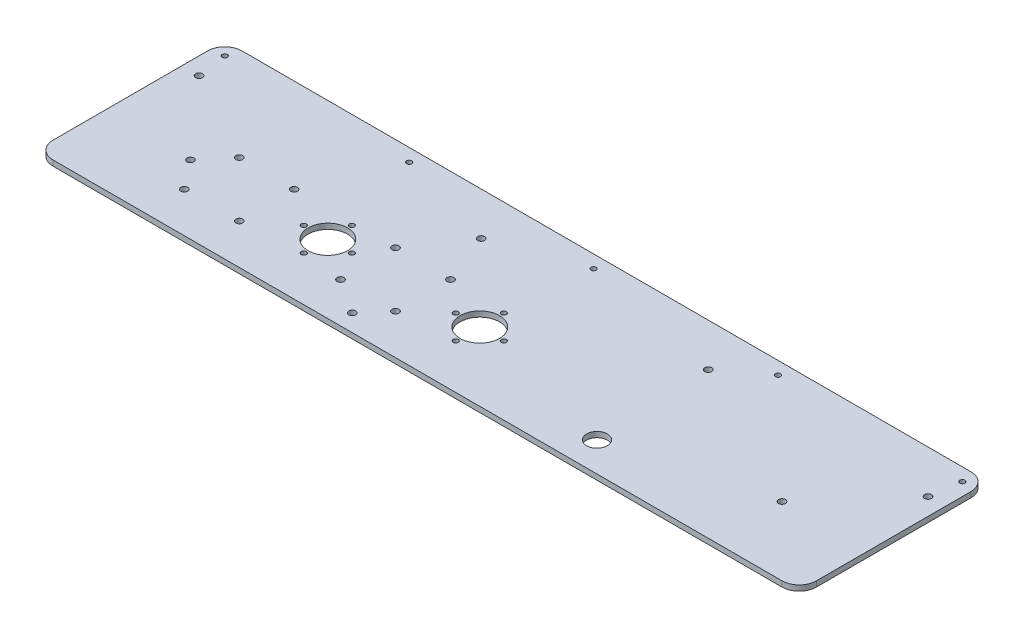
from build123d import *

# Parameters (mm, degrees)
SKETCH1_R           = 2
SKETCH1_R_2         = 1.5
SKETCH1_R_3         = 11.5
SKETCH1_R_4         = 6
BOSS_EXTRUDE1_DEPTH = 3.175
FILLET1_R           = 10
SKETCH2_R           = 2
CUT_EXTRUDE1_DEPTH  = 10


with BuildPart() as part:
    # Sketch1 → Boss-Extrude1 (new body)
    with BuildSketch(Plane(origin=(0, 0, 0), x_dir=(1, 0, 0), z_dir=(0, 1, 0))):
        Polygon((417.700422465, 110), (-26.799577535, 110), (-26.799577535, 0), (417.700422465, 0), (417.700422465, 17.22815868), align=None)
        with Locations(Location((147.450422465, 10, 0), (0, 0, 270))):
            Circle(SKETCH1_R, mode=Mode.SUBTRACT)
        with Locations(Location((103.200422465, 26, 0), (0, 0, 270))):
            Circle(SKETCH1_R_2, mode=Mode.SUBTRACT)
        with Locations(Location((23.200422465, 40, 0), (0, 0, 270))):
            Circle(SKETCH1_R, mode=Mode.SUBTRACT)
        with Locations(Location((89.200422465, 40, 0), (0, 0, 270))):
            Circle(SKETCH1_R_2, mode=Mode.SUBTRACT)
        with Locations(Location((103.200422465, 40, 0), (0, 0, 270))):
            Circle(SKETCH1_R_3, mode=Mode.SUBTRACT)
        with Locations(Location((117.200422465, 40, 0), (0, 0, 270))):
            Circle(SKETCH1_R_2, mode=Mode.SUBTRACT)
        with Locations(Location((177.700422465, 40, 0), (0, 0, 270))):
            Circle(SKETCH1_R_2, mode=Mode.SUBTRACT)
        with Locations(Location((191.700422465, 26, 0), (0, 0, 270))):
            Circle(SKETCH1_R_2, mode=Mode.SUBTRACT)
        with Locations(Location((191.700422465, 40, 0), (0, 0, 270))):
            Circle(SKETCH1_R_3, mode=Mode.SUBTRACT)
        with Locations(Location((205.700422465, 40, 0), (0, 0, 270))):
            Circle(SKETCH1_R_2, mode=Mode.SUBTRACT)
        with Locations(Location((103.200422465, 54, 0), (0, 0, 270))):
            Circle(SKETCH1_R_2, mode=Mode.SUBTRACT)
        with Locations(Location((191.700422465, 54, 0), (0, 0, 270))):
            Circle(SKETCH1_R_2, mode=Mode.SUBTRACT)
        with Locations(Location((282.700422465, 17.22815868, 0), (0, 0, 270))):
            Circle(SKETCH1_R_4, mode=Mode.SUBTRACT)
        with Locations(Location((367.700422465, 40, 0), (0, 0, 270))):
            Circle(SKETCH1_R, mode=Mode.SUBTRACT)
        with Locations(Location((-16.799577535, 85, 0), (0, 0, 270))):
            Circle(SKETCH1_R, mode=Mode.SUBTRACT)
        with Locations(Location((-19.299577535, 102.5, 0), (0, 0, 270))):
            Circle(SKETCH1_R_2, mode=Mode.SUBTRACT)
        with Locations(Location((147.450422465, 85, 0), (0, 0, 270))):
            Circle(SKETCH1_R, mode=Mode.SUBTRACT)
        with Locations(Location((88.075422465, 102.5, 0), (0, 0, 270))):
            Circle(SKETCH1_R_2, mode=Mode.SUBTRACT)
        with Locations(Location((279.700422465, 85, 0), (0, 0, 270))):
            Circle(SKETCH1_R, mode=Mode.SUBTRACT)
        with Locations(Location((195.450422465, 102.5, 0), (0, 0, 270))):
            Circle(SKETCH1_R_2, mode=Mode.SUBTRACT)
        with Locations(Location((302.825422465, 102.5, 0), (0, 0, 270))):
            Circle(SKETCH1_R_2, mode=Mode.SUBTRACT)
        with Locations(Location((407.700422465, 85, 0), (0, 0, 270))):
            Circle(SKETCH1_R, mode=Mode.SUBTRACT)
        with Locations(Location((410.200422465, 102.5, 0), (0, 0, 270))):
            Circle(SKETCH1_R_2, mode=Mode.SUBTRACT)
    extrude(amount=BOSS_EXTRUDE1_DEPTH)

    # Fillet1
    fillet1_edges = [part.edges().sort_by_distance(p)[0] for p in [
        (417.700422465, 1.5875, 0),
        (-26.799577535, 1.5875, 0),
        (-26.799577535, 1.5875, -110),
        (417.700422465, 1.5875, -110),
    ]]
    fillet(fillet1_edges, radius=FILLET1_R)

    # Sketch2 → Cut-Extrude1 (cut)
    with BuildSketch(Plane(origin=(0, 3.175, 0), x_dir=(1, 0, 0), z_dir=(0, 1, 0))):
        with Locations(Location((36.200422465, 55.40559892, 0), (0, 0, 270))):
            Circle(SKETCH2_R)
        with Locations(Location((68.200422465, 55.40559892, 0), (0, 0, 270))):
            Circle(SKETCH2_R)
        with Locations(Location((36.200422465, 23.40559892, 0), (0, 0, 270))):
            Circle(SKETCH2_R)
        with Locations(Location((68.200422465, 23.40559892, 0), (0, 0, 270))):
            Circle(SKETCH2_R)
        with Locations(Location((127.200422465, 55.40559892, 0), (0, 0, 270))):
            Circle(SKETCH2_R)
        with Locations(Location((159.200422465, 55.40559892, 0), (0, 0, 270))):
            Circle(SKETCH2_R)
        with Locations(Location((159.200422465, 23.40559892, 0), (0, 0, 270))):
            Circle(SKETCH2_R)
        with Locations(Location((127.200422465, 23.40559892, 0), (0, 0, 270))):
            Circle(SKETCH2_R)
    extrude(amount=-CUT_EXTRUDE1_DEPTH, mode=Mode.SUBTRACT)


solid = part.part
